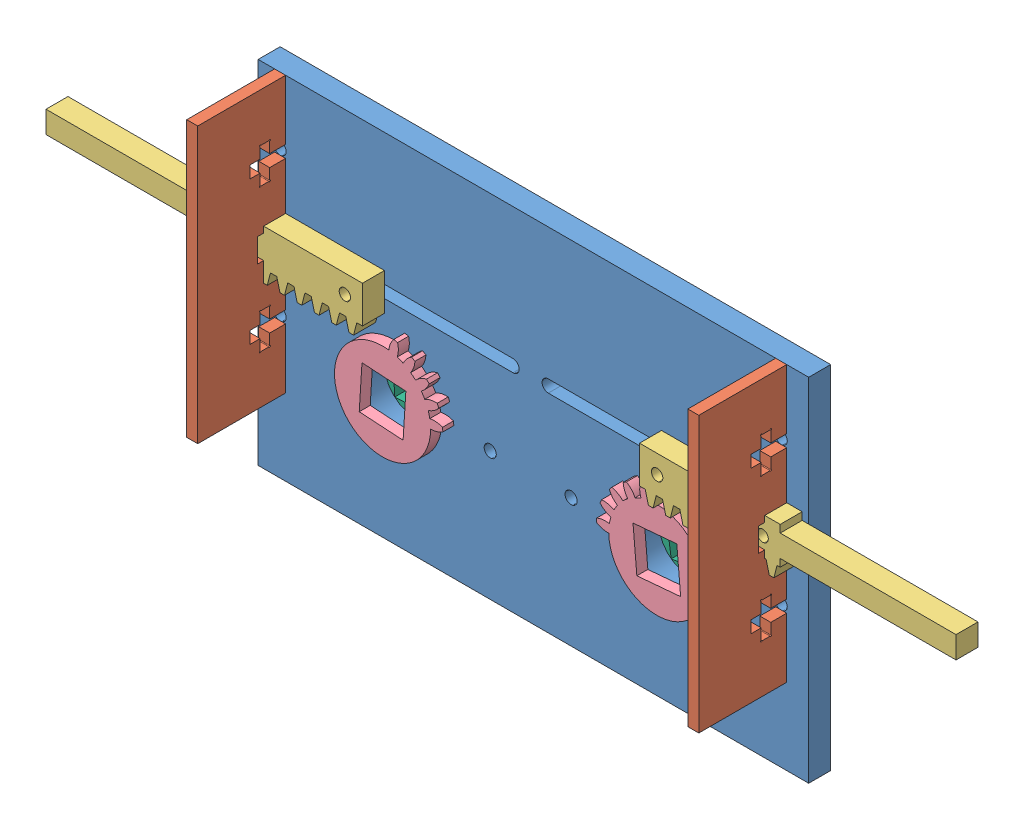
SolidWorks assembly ScreenMechanismFinal.SLDASM, configuration Default (file format 4700). Lengths in mm.
Overall size (131.47 50.8 19.05).
15 component instances, 7 part files, 26 mates.
Components (placement in the parent):
- basefinal-1: basefinal.SLDPRT [Default] at (104.5756 -19.7614 -41.7575) size (79.53 50.8 3.18)
- wallfinal-1: wallfinal.SLDPRT [Default] at (-74.3041 -19.2081 -34.6831) x (0 1 0) z (1 0 0) size (39.75 15.88 1.59)
- wallfinal-2: wallfinal.SLDPRT [Default] at (1.2609 -36.7606 -34.6831) x (0 -1 0) z (-1 0 0) size (39.75 15.88 1.59)
- rackfinal-1: rackfinal.sldprt [Inch - Rack-spur - rectangular 16DP 14.5PA .25FW .5PH 1.6inL---SAll] at (3.6903 -22.4428 -32.2325) x (-1 0 0) z (0 0 1) size (45.72 7.14 3.18)
- rackfinal-2: rackfinal.sldprt [Inch - Rack-spur - rectangular 16DP 14.5PA .25FW .5PH 1.6inL---SAll] at (-78.9522 -22.4428 -38.5825) x (1 0 0) z (0 0 -1) size (45.72 7.14 3.18)
- spurfinal-1: spurfinal.SLDPRT [Inch - Spur gear 16DP 20T 14.5PA 0.125FW ---S20N3.0H2.0L0.125N] at (-56.7574 -40.7057 -37.7887) x (0 0 1) z (-0.99803 0.062742 0) size (1.59 15.61 15.61)
- spurfinal-2: spurfinal.SLDPRT [Inch - Spur gear 16DP 20T 14.5PA 0.125FW ---S20N3.0H2.0L0.125N] at (-16.2766 -40.6951 -34.6137) x (0 0 -1) z (0.996169 0.087444 0) size (1.59 15.61 15.61)
- interfacespur3-1: interfacespur3.SLDPRT [Inch - Spur gear 16DP 14T 14.5PA .25FW ---S14N3.0H2.0L0.25N] at (-30.6796 -40.332 -38.5825) x (0 0 -1) z (0.979493 -0.201479 0) size (3.18 12.48 12.7)
- interfacespur3-2: interfacespur3.SLDPRT [Inch - Spur gear 16DP 14T 14.5PA .25FW ---S14N3.0H2.0L0.25N] at (-42.3636 -40.332 -44.9325) x (0 0 1) z (-0.917642 -0.397408 0) size (3.18 12.48 12.7)
- fullspur-1: fullspur.SLDPRT [Inch - Spur gear 16DP 20T 14.5PA .25FW ---S20N3.0H2.0L0.25N] at (-56.3336 -40.332 -38.5825) x (0 0 -1) z (-0.998695 -0.051064 0) size (3.18 17.33 17.33)
- fullspur-2: fullspur.SLDPRT [Inch - Spur gear 16DP 20T 14.5PA .25FW ---S20N3.0H2.0L0.25N] at (-16.7096 -40.332 -38.5825) x (0 0 -1) z (0.989523 0.144374 0) size (3.18 17.33 17.33)
- spacer1-1: spacer1.SLDPRT [Default] at (-182.3104 -58.4556 -21.8172) (suppressed, hidden)
- spacer1-2: spacer1.SLDPRT [Default] at (-227.0204 -46.7984 -19.4267) (suppressed, hidden)
- spacer1-3: spacer1.SLDPRT [Default] at (-193.1366 -29.6419 -16.0851) (suppressed, hidden)
- spacer1-4: spacer1.SLDPRT [Default] at (-222.833 -15.6438 -14.7267) (suppressed, hidden)
Mates (geometry in assembly coordinates):
- Coincident1: coincident anti-aligned: plane of basefinal-1 through (-73.5103 -14.4589 -30.772) normal (0 1 0); plane of wallfinal-1 through (-71.9228 -14.4589 -36.995) normal (0 -1 0)
- Coincident2: coincident aligned: plane of basefinal-1 through (-75.8916 -58.9089 -40.17) normal (0 0 -1); plane of wallfinal-1 through (-71.9228 -14.4589 -40.17) normal (0 0 -1)
- Coincident3: coincident anti-aligned: plane of basefinal-1 through (-71.9228 -11.2839 -30.772) normal (-1 0 0); plane of wallfinal-1 through (-71.9228 -47.8599 -36.995) normal (1 0 0)
- Coincident4: coincident anti-aligned: plane of basefinal-1 through (-1.1203 -11.2839 -30.772) normal (1 0 0); plane of wallfinal-2 through (-1.1203 -8.1089 -36.995) normal (-1 0 0)
- Coincident5: coincident anti-aligned: plane of basefinal-1 through (-1.1203 -11.2839 -30.772) normal (0 -1 0); plane of wallfinal-2 through (-1.1203 -11.2839 -36.995) normal (0 1 0)
- Coincident6: coincident aligned: plane of basefinal-1 through (-75.8916 -58.9089 -40.17) normal (0 0 -1); plane of wallfinal-2 through (-1.1203 -11.2839 -40.17) normal (0 0 -1)
- Coincident8: coincident anti-aligned: plane of basefinal-1 through (-75.8916 -58.9089 -36.995) normal (0 0 1); plane of rackfinal-2 through (-77.9638 -32.5413 -36.995) normal (0 0 -1)
- Coincident9: coincident anti-aligned: plane of basefinal-1 through (-75.8916 -58.9089 -36.995) normal (0 0 1); plane of rackfinal-1 through (2.7019 -32.5413 -36.995) normal (0 0 -1)
- Concentric1: concentric aligned: cylinder of basefinal-1 through (-42.3636 -40.332 -30.772) axis (0 0 -1) radius 0.8763; cylinder of interfacespur3-2 through (-42.3636 -40.332 -40.17) axis (0 0 -1) radius 0.8795
- Concentric2: concentric anti-aligned: cylinder of basefinal-1 through (-30.6796 -40.332 -30.772) axis (0 0 -1) radius 0.8763; cylinder of interfacespur3-1 through (-30.6796 -40.332 -43.345) axis (0 0 1) radius 0.8795
- Concentric3: concentric anti-aligned: cylinder of basefinal-1 through (-56.3336 -40.332 -30.772) axis (0 0 -1) radius 4.4958; cylinder of fullspur-1 through (-56.3336 -40.332 -43.345) axis (0 0 1) radius 6.9447
- Coincident11: coincident anti-aligned: plane of basefinal-1 through (-75.8916 -58.9089 -40.17) normal (0 0 -1); plane of fullspur-1 through (-56.3336 -40.332 -40.17) normal (0 0 1)
- Concentric4: concentric anti-aligned: cylinder of basefinal-1 through (-16.7096 -40.332 -30.772) axis (0 0 -1) radius 4.4958; cylinder of fullspur-2 through (-16.7096 -40.332 -43.345) axis (0 0 1) radius 6.9447
- Coincident12: coincident anti-aligned: plane of basefinal-1 through (-75.8916 -58.9089 -40.17) normal (0 0 -1); plane of fullspur-2 through (-16.7096 -40.332 -40.17) normal (0 0 1)
- Coincident13: coincident anti-aligned: plane of basefinal-1 through (-75.8916 -58.9089 -40.17) normal (0 0 -1); plane of interfacespur3-1 through (-30.6796 -40.332 -40.17) normal (0 0 1)
- Coincident14: coincident anti-aligned: plane of basefinal-1 through (-75.8916 -58.9089 -40.17) normal (0 0 -1); plane of interfacespur3-2 through (-42.3636 -40.332 -40.17) normal (0 0 1)
- Concentric5: concentric anti-aligned: cylinder of basefinal-1 through (-16.7096 -40.332 -30.772) axis (0 0 -1) radius 4.4958; circle of spurfinal-2
- Concentric6: concentric aligned: cylinder of basefinal-1 through (-56.3336 -40.332 -30.772) axis (0 0 -1) radius 4.4958; circle of spurfinal-1
- Coincident15: coincident anti-aligned: plane of basefinal-1 through (-75.8916 -58.9089 -36.995) normal (0 0 1); plane of spurfinal-1 through (-56.3336 -40.332 -36.995) normal (0 0 -1)
- Coincident16: coincident anti-aligned: plane of basefinal-1 through (-75.8916 -58.9089 -36.995) normal (0 0 1); plane of spurfinal-2 through (-16.7096 -40.332 -36.995) normal (0 0 -1)
- Coincident17: coincident anti-aligned: plane of basefinal-1 through (-75.8916 -58.9089 -36.995) normal (0 0 1); plane of rackfinal-2 through (-77.9638 -32.5413 -36.995) normal (0 0 -1)
- Coincident18: coincident anti-aligned: plane of basefinal-1 through (-75.8916 -58.9089 -36.995) normal (0 0 1); plane of rackfinal-1 through (2.7019 -32.5413 -36.995) normal (0 0 -1)
- Tangent4: tangent anti-aligned: plane of basefinal-1 through (-69.5416 -28.902 -30.772) normal (0 1 0); cylinder of rackfinal-2 through (-60.1838 -28.0765 -32.296) axis (0 0 -1) radius 0.8255
- Tangent6: tangent anti-aligned: plane of basefinal-1 through (-69.5416 -28.902 -30.772) normal (0 1 0); cylinder of rackfinal-2 through (-75.4238 -28.0765 -32.296) axis (0 0 -1) radius 0.8255
- Tangent7: tangent anti-aligned: plane of basefinal-1 through (-3.5016 -28.902 -30.772) normal (0 1 0); cylinder of rackfinal-1 through (0.1619 -28.0765 -38.519) axis (0 0 1) radius 0.8255
- Tangent8: tangent anti-aligned: plane of basefinal-1 through (-3.5016 -28.902 -30.772) normal (0 1 0); cylinder of rackfinal-1 through (-15.0781 -28.0765 -38.519) axis (0 0 1) radius 0.8255
